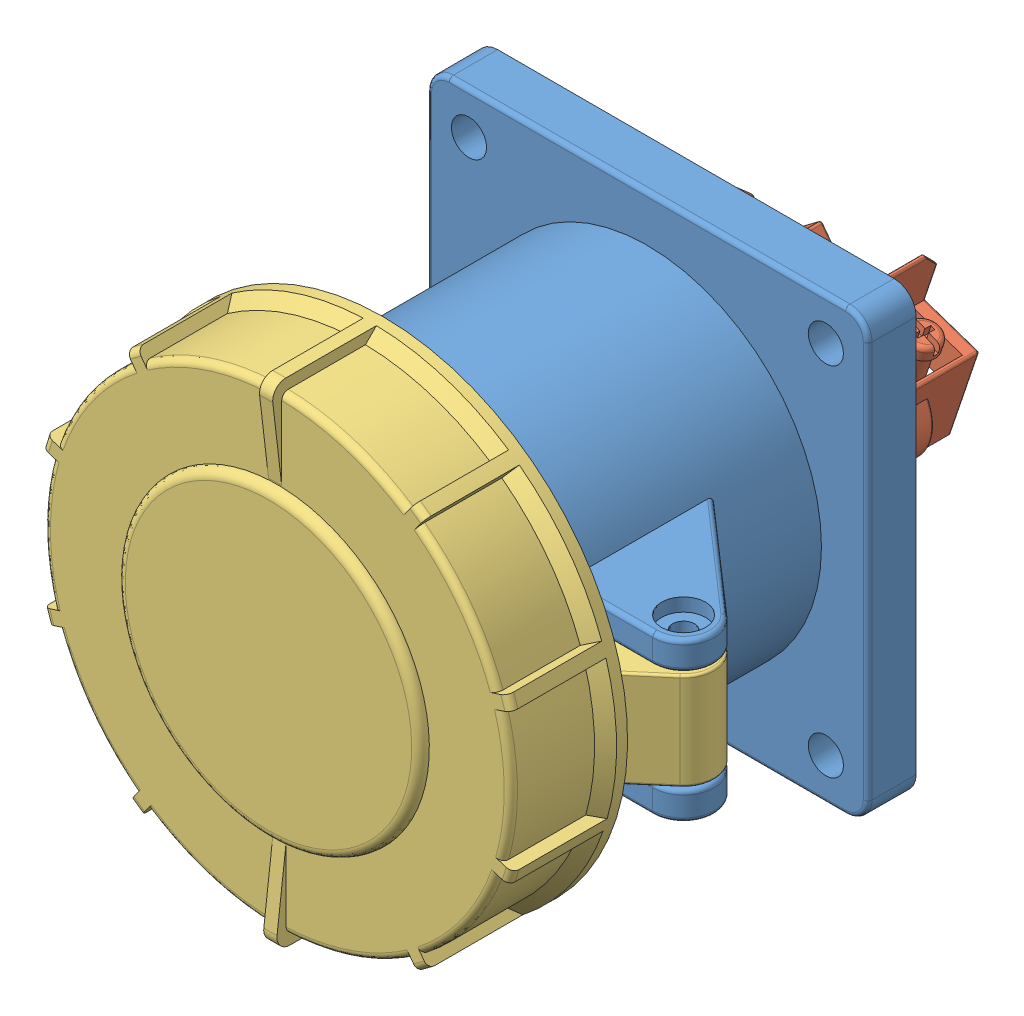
SolidWorks assembly Розетка стационарная внутренняя ps-3342-63-380.SLDASM, configuration По умолчанию (file format 10000). Lengths in mm.
Overall size (117.7 111.32 132.28).
3 component instances, 3 part files, 5 mates.
Components (placement in the parent):
- Корпус 3352,3342-1: Корпус 3352,3342.SLDPRT [По умолчанию] at (67.556 63.1304 16.5491) size (112.2 100 82)
- Колодка 3342,4342-1: Колодка 3342,4342.SLDPRT [По умолчанию] at (67.556 63.1304 16.5491) x (0.032521 -0.999471 0) z (0 0 -1) size (72 72 112.04)
- Крышка 3342, 4342, 3352, 4352-1: Крышка 3342, 4342, 3352, 4352.SLDPRT [По умолчанию] at (67.556 63.1304 111.5491) x (0 1 0) z (0 0 -1) size (111.32 117.7 46.24)
Mates (geometry in assembly coordinates):
- Концентричный1: concentric anti-aligned: cylinder of Корпус 3352,3342-1 through (67.556 63.1304 -8.4509) axis (0 0 1) radius 36.5; cylinder of Колодка 3342,4342-1 through (67.556 63.1304 93.5491) axis (0 0 -1) radius 30
- Совпадение1: coincident anti-aligned: plane of Корпус 3352,3342-1 through (67.556 63.1304 16.5491) normal (0 0 -1); plane of Колодка 3342,4342-1 through (67.556 63.1304 16.5491) normal (0 0 1)
- Концентричный2: concentric aligned: cylinder of Корпус 3352,3342-1 through (67.556 63.1304 98.5491) axis (0 0 -1) radius 39.5; cylinder of Крышка 3342, 4342, 3352, 4352-1 through (67.556 63.1304 98.5491) axis (0 0 -1) radius 50.5
- Параллельность1: parallel anti-aligned: plane of Корпус 3352,3342-1 through (136.9985 74.6304 37.5491) normal (0 -1 0); plane of Крышка 3342, 4342, 3352, 4352-1 through (122.7559 74.1304 74.5491) normal (0 1 0)
- Совпадение2: coincident anti-aligned: plane of Корпус 3352,3342-1 through (67.556 63.1304 98.5491) normal (0 0 1); plane of Крышка 3342, 4342, 3352, 4352-1 through (67.556 63.1304 98.5491) normal (0 0 -1)
